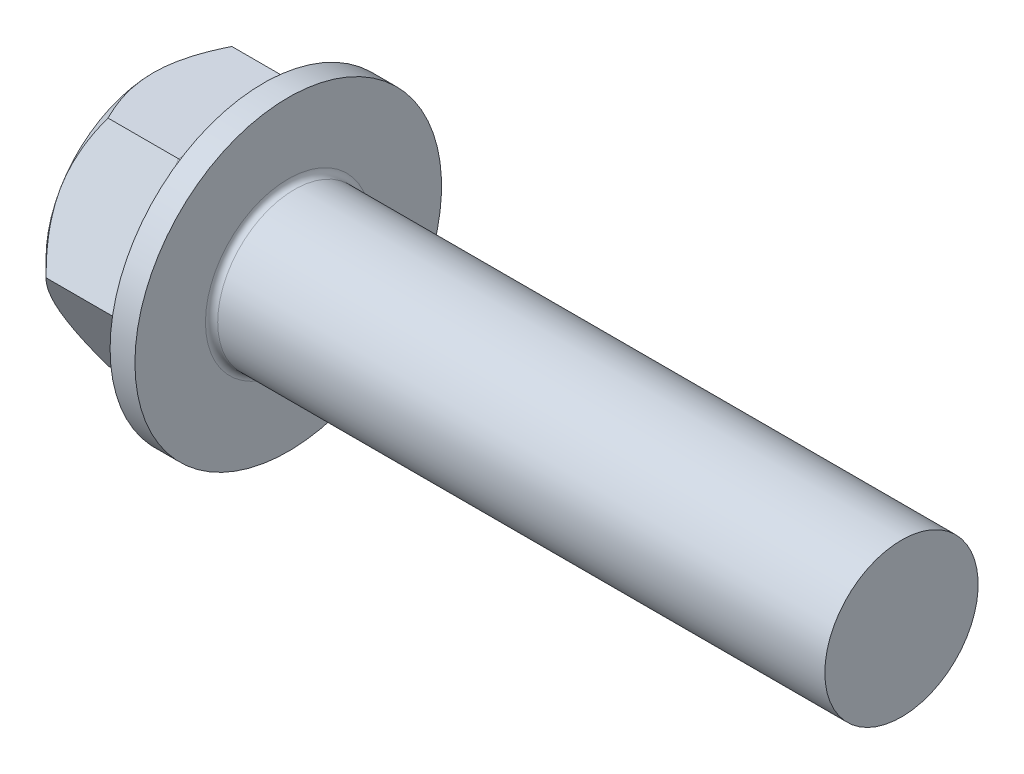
ISO-10303-21;
HEADER;
FILE_DESCRIPTION(('STEP AP214'),'2;1');
FILE_NAME('part.step','',(''),(''),'','','');
FILE_SCHEMA(('AUTOMOTIVE_DESIGN { 1 0 10303 214 1 1 1 1 }'));
ENDSEC;
DATA;
#1=APPLICATION_CONTEXT('core data for automotive mechanical design processes');
#2=APPLICATION_PROTOCOL_DEFINITION('international standard','automotive_design',2000,#1);
#3=PRODUCT_CONTEXT('',#1,'mechanical');
#4=PRODUCT('Part','Part','',(#3));
#5=PRODUCT_RELATED_PRODUCT_CATEGORY('part','',(#4));
#6=PRODUCT_DEFINITION_FORMATION('','',#4);
#7=PRODUCT_DEFINITION_CONTEXT('part definition',#1,'design');
#8=PRODUCT_DEFINITION('design','',#6,#7);
#9=PRODUCT_DEFINITION_SHAPE('','',#8);
#10=(LENGTH_UNIT() NAMED_UNIT(*) SI_UNIT(.MILLI.,.METRE.));
#11=(NAMED_UNIT(*) PLANE_ANGLE_UNIT() SI_UNIT($,.RADIAN.));
#12=(NAMED_UNIT(*) SI_UNIT($,.STERADIAN.) SOLID_ANGLE_UNIT());
#13=UNCERTAINTY_MEASURE_WITH_UNIT(LENGTH_MEASURE(1.E-05),#10,'distance_accuracy_value','');
#14=(GEOMETRIC_REPRESENTATION_CONTEXT(3) GLOBAL_UNCERTAINTY_ASSIGNED_CONTEXT((#13)) GLOBAL_UNIT_ASSIGNED_CONTEXT((#10,
#11,#12)) REPRESENTATION_CONTEXT('',''));
#15=CARTESIAN_POINT('',(0.,0.,0.));
#16=DIRECTION('',(0.,0.,1.));
#17=DIRECTION('',(1.,0.,0.));
#18=AXIS2_PLACEMENT_3D('',#15,#16,#17);
#19=CARTESIAN_POINT('',(0.,0.,0.));
#20=DIRECTION('',(1.,0.,0.));
#21=DIRECTION('',(0.,0.,-1.));
#22=AXIS2_PLACEMENT_3D('',#19,#20,#21);
#23=PLANE('',#22);
#24=CARTESIAN_POINT('',(0.,0.,0.));
#25=DIRECTION('',(1.,0.,0.));
#26=DIRECTION('',(0.,0.,-1.));
#27=AXIS2_PLACEMENT_3D('',#24,#25,#26);
#28=CIRCLE('',#27,7.);
#29=CARTESIAN_POINT('',(0.,-3.5,-6.06217782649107));
#30=VERTEX_POINT('',#29);
#31=CARTESIAN_POINT('',(0.,3.5,-6.06217782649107));
#32=VERTEX_POINT('',#31);
#33=EDGE_CURVE('E168',#30,#32,#28,.T.);
#34=ORIENTED_EDGE('',*,*,#33,.F.);
#35=CARTESIAN_POINT('',(0.,-7.,0.));
#36=VERTEX_POINT('',#35);
#37=EDGE_CURVE('E171',#36,#30,#28,.T.);
#38=ORIENTED_EDGE('',*,*,#37,.F.);
#39=CARTESIAN_POINT('',(0.,-3.5,6.06217782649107));
#40=VERTEX_POINT('',#39);
#41=EDGE_CURVE('E177',#40,#36,#28,.T.);
#42=ORIENTED_EDGE('',*,*,#41,.F.);
#43=CARTESIAN_POINT('',(0.,3.5,6.06217782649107));
#44=VERTEX_POINT('',#43);
#45=EDGE_CURVE('E169',#44,#40,#28,.T.);
#46=ORIENTED_EDGE('',*,*,#45,.F.);
#47=CARTESIAN_POINT('',(0.,7.,0.));
#48=VERTEX_POINT('',#47);
#49=EDGE_CURVE('E167',#48,#44,#28,.T.);
#50=ORIENTED_EDGE('',*,*,#49,.F.);
#51=EDGE_CURVE('E144',#32,#48,#28,.T.);
#52=ORIENTED_EDGE('',*,*,#51,.F.);
#53=EDGE_LOOP('',(#34,#38,#42,#46,#50,#52));
#54=FACE_BOUND('',#53,.T.);
#55=CARTESIAN_POINT('',(0.,0.,0.));
#56=DIRECTION('',(1.,0.,0.));
#57=DIRECTION('',(0.,0.,-1.));
#58=AXIS2_PLACEMENT_3D('',#55,#56,#57);
#59=CIRCLE('',#58,5.95);
#60=CARTESIAN_POINT('',(0.,0.,-5.95));
#61=VERTEX_POINT('',#60);
#62=EDGE_CURVE('E179',#61,#61,#59,.T.);
#63=ORIENTED_EDGE('',*,*,#62,.T.);
#64=EDGE_LOOP('',(#63));
#65=FACE_BOUND('',#64,.T.);
#66=ADVANCED_FACE('F33',(#54,#65),#23,.F.);
#67=CARTESIAN_POINT('',(7.18,10.,0.));
#68=DIRECTION('',(1.,0.,0.));
#69=DIRECTION('',(0.,0.,-1.));
#70=AXIS2_PLACEMENT_3D('',#67,#68,#69);
#71=PLANE('',#70);
#72=DIRECTION('',(0.,0.866025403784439,-0.5));
#73=VECTOR('',#72,1.);
#74=CARTESIAN_POINT('',(7.18,-0.749999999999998,-9.38194187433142));
#75=LINE('',#74,#73);
#76=CARTESIAN_POINT('',(7.18,-8.5,-4.90747728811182));
#77=VERTEX_POINT('',#76);
#78=CARTESIAN_POINT('',(7.18,0.,-9.81495457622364));
#79=VERTEX_POINT('',#78);
#80=EDGE_CURVE('E219',#77,#79,#75,.T.);
#81=ORIENTED_EDGE('',*,*,#80,.T.);
#82=DIRECTION('',(0.,0.866025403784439,0.5));
#83=VECTOR('',#82,1.);
#84=CARTESIAN_POINT('',(7.18,7.75,-5.34048999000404));
#85=LINE('',#84,#83);
#86=CARTESIAN_POINT('',(7.18,8.5,-4.90747728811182));
#87=VERTEX_POINT('',#86);
#88=EDGE_CURVE('E230',#79,#87,#85,.T.);
#89=ORIENTED_EDGE('',*,*,#88,.T.);
#90=DIRECTION('',(0.,0.,1.));
#91=VECTOR('',#90,1.);
#92=CARTESIAN_POINT('',(7.18,8.5,4.04145188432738));
#93=LINE('',#92,#91);
#94=CARTESIAN_POINT('',(7.18,8.5,4.90747728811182));
#95=VERTEX_POINT('',#94);
#96=EDGE_CURVE('E237',#87,#95,#93,.T.);
#97=ORIENTED_EDGE('',*,*,#96,.T.);
#98=DIRECTION('',(0.,-0.866025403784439,0.5));
#99=VECTOR('',#98,1.);
#100=CARTESIAN_POINT('',(7.18,0.749999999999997,9.38194187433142));
#101=LINE('',#100,#99);
#102=CARTESIAN_POINT('',(7.18,0.,9.81495457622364));
#103=VERTEX_POINT('',#102);
#104=EDGE_CURVE('E239',#95,#103,#101,.T.);
#105=ORIENTED_EDGE('',*,*,#104,.T.);
#106=DIRECTION('',(0.,-0.866025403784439,-0.5));
#107=VECTOR('',#106,1.);
#108=CARTESIAN_POINT('',(7.18,-7.75000000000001,5.34048999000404));
#109=LINE('',#108,#107);
#110=CARTESIAN_POINT('',(7.18,-8.5,4.90747728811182));
#111=VERTEX_POINT('',#110);
#112=EDGE_CURVE('E235',#103,#111,#109,.T.);
#113=ORIENTED_EDGE('',*,*,#112,.T.);
#114=DIRECTION('',(0.,0.,-1.));
#115=VECTOR('',#114,1.);
#116=CARTESIAN_POINT('',(7.18,-8.5,-4.04145188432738));
#117=LINE('',#116,#115);
#118=EDGE_CURVE('E221',#111,#77,#117,.T.);
#119=ORIENTED_EDGE('',*,*,#118,.T.);
#120=EDGE_LOOP('',(#81,#89,#97,#105,#113,#119));
#121=FACE_BOUND('',#120,.T.);
#122=CARTESIAN_POINT('',(7.18,0.,0.));
#123=DIRECTION('',(-1.,0.,0.));
#124=DIRECTION('',(0.,0.,1.));
#125=AXIS2_PLACEMENT_3D('',#122,#123,#124);
#126=CIRCLE('',#125,10.);
#127=CARTESIAN_POINT('',(7.18,0.,10.));
#128=VERTEX_POINT('',#127);
#129=EDGE_CURVE('E249',#128,#128,#126,.T.);
#130=ORIENTED_EDGE('',*,*,#129,.T.);
#131=EDGE_LOOP('',(#130));
#132=FACE_BOUND('',#131,.T.);
#133=ADVANCED_FACE('F312',(#121,#132),#71,.F.);
#134=CARTESIAN_POINT('',(0.,0.,0.));
#135=DIRECTION('',(-1.,0.,0.));
#136=DIRECTION('',(0.,0.,1.));
#137=AXIS2_PLACEMENT_3D('',#134,#135,#136);
#138=CYLINDRICAL_SURFACE('',#137,10.);
#139=ORIENTED_EDGE('',*,*,#129,.F.);
#140=EDGE_LOOP('',(#139));
#141=FACE_BOUND('',#140,.T.);
#142=CARTESIAN_POINT('',(8.8,0.,0.));
#143=DIRECTION('',(-1.,0.,0.));
#144=DIRECTION('',(0.,0.,1.));
#145=AXIS2_PLACEMENT_3D('',#142,#143,#144);
#146=CIRCLE('',#145,10.);
#147=CARTESIAN_POINT('',(8.8,0.,10.));
#148=VERTEX_POINT('',#147);
#149=EDGE_CURVE('E363',#148,#148,#146,.T.);
#150=ORIENTED_EDGE('',*,*,#149,.T.);
#151=EDGE_LOOP('',(#150));
#152=FACE_BOUND('',#151,.T.);
#153=ADVANCED_FACE('F309',(#141,#152),#138,.T.);
#154=CARTESIAN_POINT('',(8.8,10.,0.));
#155=DIRECTION('',(-1.,0.,0.));
#156=DIRECTION('',(0.,0.,1.));
#157=AXIS2_PLACEMENT_3D('',#154,#155,#156);
#158=PLANE('',#157);
#159=CARTESIAN_POINT('',(8.8,0.,0.));
#160=DIRECTION('',(-1.,0.,0.));
#161=DIRECTION('',(0.,0.,1.));
#162=AXIS2_PLACEMENT_3D('',#159,#160,#161);
#163=CIRCLE('',#162,5.4);
#164=CARTESIAN_POINT('',(8.8,0.,5.4));
#165=VERTEX_POINT('',#164);
#166=EDGE_CURVE('E41',#165,#165,#163,.T.);
#167=ORIENTED_EDGE('',*,*,#166,.T.);
#168=EDGE_LOOP('',(#167));
#169=FACE_BOUND('',#168,.T.);
#170=ORIENTED_EDGE('',*,*,#149,.F.);
#171=EDGE_LOOP('',(#170));
#172=FACE_BOUND('',#171,.T.);
#173=ADVANCED_FACE('F305',(#169,#172),#158,.F.);
#174=CARTESIAN_POINT('',(0.,0.,0.));
#175=DIRECTION('',(-1.,0.,0.));
#176=DIRECTION('',(0.,0.,1.));
#177=AXIS2_PLACEMENT_3D('',#174,#175,#176);
#178=CYLINDRICAL_SURFACE('',#177,5.);
#179=CARTESIAN_POINT('',(9.2,0.,0.));
#180=DIRECTION('',(-1.,0.,0.));
#181=DIRECTION('',(0.,0.,1.));
#182=AXIS2_PLACEMENT_3D('',#179,#180,#181);
#183=CIRCLE('',#182,5.);
#184=CARTESIAN_POINT('',(9.2,0.,5.));
#185=VERTEX_POINT('',#184);
#186=EDGE_CURVE('E11',#185,#185,#183,.F.);
#187=ORIENTED_EDGE('',*,*,#186,.T.);
#188=EDGE_LOOP('',(#187));
#189=FACE_BOUND('',#188,.T.);
#190=CARTESIAN_POINT('',(48.8,0.,0.));
#191=DIRECTION('',(-1.,0.,0.));
#192=DIRECTION('',(0.,0.,1.));
#193=AXIS2_PLACEMENT_3D('',#190,#191,#192);
#194=CIRCLE('',#193,5.);
#195=CARTESIAN_POINT('',(48.8,0.,5.));
#196=VERTEX_POINT('',#195);
#197=EDGE_CURVE('E361',#196,#196,#194,.T.);
#198=ORIENTED_EDGE('',*,*,#197,.T.);
#199=EDGE_LOOP('',(#198));
#200=FACE_BOUND('',#199,.T.);
#201=ADVANCED_FACE('F301',(#189,#200),#178,.T.);
#202=CARTESIAN_POINT('',(48.8,5.,0.));
#203=DIRECTION('',(-1.,0.,0.));
#204=DIRECTION('',(0.,0.,1.));
#205=AXIS2_PLACEMENT_3D('',#202,#203,#204);
#206=PLANE('',#205);
#207=ORIENTED_EDGE('',*,*,#197,.F.);
#208=EDGE_LOOP('',(#207));
#209=FACE_BOUND('',#208,.T.);
#210=ADVANCED_FACE('F295',(#209),#206,.F.);
#211=CARTESIAN_POINT('',(500000.,0.,8.08290376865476));
#212=DIRECTION('',(0.,0.5,-0.866025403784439));
#213=DIRECTION('',(0.,0.866025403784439,0.5));
#214=AXIS2_PLACEMENT_3D('',#211,#212,#213);
#215=PLANE('',#214);
#216=DIRECTION('',(-1.,0.,0.));
#217=VECTOR('',#216,1.);
#218=CARTESIAN_POINT('',(500000.,-7.,4.04145188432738));
#219=LINE('',#218,#217);
#220=CARTESIAN_POINT('',(5.68000000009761,-7.,4.04145188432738));
#221=VERTEX_POINT('',#220);
#222=CARTESIAN_POINT('',(1.08290376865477,-7.,4.04145188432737));
#223=VERTEX_POINT('',#222);
#224=EDGE_CURVE('E359',#221,#223,#219,.T.);
#225=ORIENTED_EDGE('',*,*,#224,.F.);
#226=DIRECTION('',(0.,-0.866025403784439,-0.5));
#227=VECTOR('',#226,1.);
#228=CARTESIAN_POINT('',(5.68,0.,8.08290376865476));
#229=LINE('',#228,#227);
#230=CARTESIAN_POINT('',(5.68000000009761,0.,8.08290376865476));
#231=VERTEX_POINT('',#230);
#232=EDGE_CURVE('E56',#221,#231,#229,.F.);
#233=ORIENTED_EDGE('',*,*,#232,.T.);
#234=DIRECTION('',(-1.,0.,0.));
#235=VECTOR('',#234,1.);
#236=CARTESIAN_POINT('',(500000.,0.,8.08290376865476));
#237=LINE('',#236,#235);
#238=CARTESIAN_POINT('',(1.08290376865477,0.,8.08290376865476));
#239=VERTEX_POINT('',#238);
#240=EDGE_CURVE('E357',#231,#239,#237,.T.);
#241=ORIENTED_EDGE('',*,*,#240,.T.);
#242=CARTESIAN_POINT('',(1.08301924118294,0.000199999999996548,8.0830192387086));
#243=CARTESIAN_POINT('',(1.01353712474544,-0.120159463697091,8.01352966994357));
#244=CARTESIAN_POINT('',(0.946187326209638,-0.241444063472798,7.94350597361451));
#245=CARTESIAN_POINT('',(0.816401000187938,-0.486045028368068,7.80228554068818));
#246=CARTESIAN_POINT('',(0.753967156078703,-0.609362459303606,7.73108818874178));
#247=CARTESIAN_POINT('',(0.574480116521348,-0.98378184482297,7.51491705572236));
#248=CARTESIAN_POINT('',(0.466007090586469,-1.23805341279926,7.36811329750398));
#249=CARTESIAN_POINT('',(0.280254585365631,-1.75081233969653,7.07207179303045));
#250=CARTESIAN_POINT('',(0.202507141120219,-2.0091686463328,6.92290970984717));
#251=CARTESIAN_POINT('',(0.11257250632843,-2.40095049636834,6.69671435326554));
#252=CARTESIAN_POINT('',(0.0870540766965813,-2.53212124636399,6.62098288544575));
#253=CARTESIAN_POINT('',(0.0454901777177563,-2.7955733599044,6.46887873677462));
#254=CARTESIAN_POINT('',(0.0294432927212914,-2.92785455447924,6.3925061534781));
#255=CARTESIAN_POINT('',(0.00253830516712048,-3.25020698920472,6.20639588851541));
#256=CARTESIAN_POINT('',(-0.00310677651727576,-3.44062555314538,6.09645767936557));
#257=CARTESIAN_POINT('',(0.00636879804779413,-3.82111946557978,5.87677941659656));
#258=CARTESIAN_POINT('',(0.021496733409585,-4.0111946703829,5.7670394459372));
#259=CARTESIAN_POINT('',(0.0716266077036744,-4.38955306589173,5.54859412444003));
#260=CARTESIAN_POINT('',(0.106650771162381,-4.57783401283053,5.43989006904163));
#261=CARTESIAN_POINT('',(0.194668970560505,-4.95115981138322,5.22435031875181));
#262=CARTESIAN_POINT('',(0.247661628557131,-5.1362049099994,5.11751448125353));
#263=CARTESIAN_POINT('',(0.35668282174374,-5.46469033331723,4.92786333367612));
#264=CARTESIAN_POINT('',(0.40984393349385,-5.60885807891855,4.84462804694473));
#265=CARTESIAN_POINT('',(0.524732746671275,-5.89460563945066,4.67965161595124));
#266=CARTESIAN_POINT('',(0.586460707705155,-6.03618537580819,4.59791051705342));
#267=CARTESIAN_POINT('',(0.71709954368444,-6.31631098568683,4.43617992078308));
#268=CARTESIAN_POINT('',(0.785987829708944,-6.45486482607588,4.35618582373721));
#269=CARTESIAN_POINT('',(0.93004292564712,-6.72940692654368,4.19767886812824));
#270=CARTESIAN_POINT('',(1.00520588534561,-6.86539669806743,4.11916513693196));
#271=CARTESIAN_POINT('',(1.08301924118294,-7.0002,4.04133641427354));
#272=B_SPLINE_CURVE_WITH_KNOTS('',3,(#242,#243,#244,#245,#246,#247,#248,#249,#250,#251,#252,
#253,#254,#255,#256,#257,#258,#259,#260,#261,#262,#263,#264,#265,#266,#267,#268,#269,#270,#271),
.UNSPECIFIED.,.F.,.F.,(4,2,2,2,2,2,2,2,2,2,2,2,2,2,4),(0.,0.466112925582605,0.932478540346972,
1.87024464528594,2.79312018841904,3.25365289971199,3.71411676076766,4.37293813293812,
5.03199042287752,5.69178034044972,6.35151967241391,6.87553223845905,7.39956068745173,
7.92198344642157,8.44408796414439),.UNSPECIFIED.);
#273=EDGE_CURVE('E152',#239,#40,#272,.T.);
#274=ORIENTED_EDGE('',*,*,#273,.T.);
#275=EDGE_CURVE('E155',#40,#223,#272,.T.);
#276=ORIENTED_EDGE('',*,*,#275,.T.);
#277=EDGE_LOOP('',(#225,#233,#241,#274,#276));
#278=FACE_BOUND('',#277,.T.);
#279=ADVANCED_FACE('F292',(#278),#215,.F.);
#280=CARTESIAN_POINT('',(500000.,-7.,4.04145188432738));
#281=DIRECTION('',(0.,1.,0.));
#282=DIRECTION('',(0.,0.,1.));
#283=AXIS2_PLACEMENT_3D('',#280,#281,#282);
#284=PLANE('',#283);
#285=DIRECTION('',(-1.,0.,0.));
#286=VECTOR('',#285,1.);
#287=CARTESIAN_POINT('',(500000.,-7.,-4.04145188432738));
#288=LINE('',#287,#286);
#289=CARTESIAN_POINT('',(5.68000000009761,-7.,-4.04145188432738));
#290=VERTEX_POINT('',#289);
#291=CARTESIAN_POINT('',(1.08290376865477,-6.99999999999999,-4.04145188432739));
#292=VERTEX_POINT('',#291);
#293=EDGE_CURVE('E136',#290,#292,#288,.T.);
#294=ORIENTED_EDGE('',*,*,#293,.F.);
#295=DIRECTION('',(0.,0.,-1.));
#296=VECTOR('',#295,1.);
#297=CARTESIAN_POINT('',(5.68,-7.,4.04145188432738));
#298=LINE('',#297,#296);
#299=EDGE_CURVE('E222',#290,#221,#298,.F.);
#300=ORIENTED_EDGE('',*,*,#299,.T.);
#301=ORIENTED_EDGE('',*,*,#224,.T.);
#302=CARTESIAN_POINT('',(3.96062693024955,-7.,-8.43417706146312));
#303=CARTESIAN_POINT('',(3.80386485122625,-7.,-8.23041129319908));
#304=CARTESIAN_POINT('',(3.6485074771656,-7.,-8.02554759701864));
#305=CARTESIAN_POINT('',(3.34124389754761,-7.,-7.61317558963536));
#306=CARTESIAN_POINT('',(3.18933851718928,-7.,-7.40566666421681));
#307=CARTESIAN_POINT('',(2.88853965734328,-7.,-6.98603902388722));
#308=CARTESIAN_POINT('',(2.739678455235,-7.,-6.7738970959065));
#309=CARTESIAN_POINT('',(2.44713646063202,-7.,-6.34608257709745));
#310=CARTESIAN_POINT('',(2.30345531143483,-7.,-6.1304102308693));
#311=CARTESIAN_POINT('',(2.01354429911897,-7.,-5.68113447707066));
#312=CARTESIAN_POINT('',(1.86773051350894,-7.,-5.44726122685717));
#313=CARTESIAN_POINT('',(1.58515337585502,-7.,-4.97402257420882));
#314=CARTESIAN_POINT('',(1.44839154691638,-7.,-4.73465625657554));
#315=CARTESIAN_POINT('',(1.18683085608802,-7.,-4.25036598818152));
#316=CARTESIAN_POINT('',(1.06199687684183,-7.,-4.00546115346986));
#317=CARTESIAN_POINT('',(0.827088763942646,-7.,-3.50872825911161));
#318=CARTESIAN_POINT('',(0.717007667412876,-7.,-3.25690353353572));
#319=CARTESIAN_POINT('',(0.525534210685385,-7.,-2.77100064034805));
#320=CARTESIAN_POINT('',(0.44238295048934,-7.,-2.53762269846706));
#321=CARTESIAN_POINT('',(0.294760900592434,-7.,-2.06492104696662));
#322=CARTESIAN_POINT('',(0.230291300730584,-7.,-1.82559695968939));
#323=CARTESIAN_POINT('',(0.124596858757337,-7.,-1.34660053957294));
#324=CARTESIAN_POINT('',(0.0829498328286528,-7.,-1.10702295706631));
#325=CARTESIAN_POINT('',(0.0237693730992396,-7.,-0.624891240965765));
#326=CARTESIAN_POINT('',(0.00623093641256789,-7.,-0.382337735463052));
#327=CARTESIAN_POINT('',(-0.00323838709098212,-7.,0.0926637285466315));
#328=CARTESIAN_POINT('',(0.00374551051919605,-7.,0.325090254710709));
#329=CARTESIAN_POINT('',(0.0404439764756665,-7.,0.788129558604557));
#330=CARTESIAN_POINT('',(0.0701606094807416,-7.,1.0187421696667));
#331=CARTESIAN_POINT('',(0.15114938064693,-7.,1.48039296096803));
#332=CARTESIAN_POINT('',(0.202802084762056,-7.,1.71136323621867));
#333=CARTESIAN_POINT('',(0.324797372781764,-7.,2.16821741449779));
#334=CARTESIAN_POINT('',(0.395138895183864,-7.,2.39410160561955));
#335=CARTESIAN_POINT('',(0.55592514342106,-7.,2.85322776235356));
#336=CARTESIAN_POINT('',(0.647295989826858,-7.,3.08614168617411));
#337=CARTESIAN_POINT('',(0.844153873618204,-7.,3.54597855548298));
#338=CARTESIAN_POINT('',(0.949647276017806,-7.,3.77289874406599));
#339=CARTESIAN_POINT('',(1.17224851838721,-7.,4.22181978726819));
#340=CARTESIAN_POINT('',(1.28939213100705,-7.,4.44380275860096));
#341=CARTESIAN_POINT('',(1.5327159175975,-7.,4.88268206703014));
#342=CARTESIAN_POINT('',(1.65889470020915,-7.,5.09957918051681));
#343=CARTESIAN_POINT('',(1.91211455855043,-7.,5.51835088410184));
#344=CARTESIAN_POINT('',(2.03880536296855,-7.,5.72043839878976));
#345=CARTESIAN_POINT('',(2.29757957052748,-7.,6.12114141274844));
#346=CARTESIAN_POINT('',(2.42966337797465,-7.,6.31975665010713));
#347=CARTESIAN_POINT('',(2.69718660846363,-7.,6.71237253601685));
#348=CARTESIAN_POINT('',(2.83259057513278,-7.,6.90639743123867));
#349=CARTESIAN_POINT('',(3.10702821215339,-7.,7.29178546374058));
#350=CARTESIAN_POINT('',(3.24606087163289,-7.,7.48314932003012));
#351=CARTESIAN_POINT('',(3.38657884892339,-7.,7.67339691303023));
#352=B_SPLINE_CURVE_WITH_KNOTS('',3,(#302,#303,#304,#305,#306,#307,#308,#309,#310,#311,#312,
#313,#314,#315,#316,#317,#318,#319,#320,#321,#322,#323,#324,#325,#326,#327,#328,#329,#330,#331,
#332,#333,#334,#335,#336,#337,#338,#339,#340,#341,#342,#343,#344,#345,#346,#347,#348,#349,#350,
#351),.UNSPECIFIED.,.F.,.F.,(4,2,2,2,2,2,2,2,2,2,2,2,2,2,2,2,2,2,2,2,2,2,2,2,4),(0.,
0.771281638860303,1.54274575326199,2.32016156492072,3.09752374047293,3.92417717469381,
4.75096935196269,5.57524705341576,6.3991343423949,7.14173972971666,7.88439240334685,
8.61279864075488,9.34105370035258,10.0374943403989,10.7339982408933,11.4431138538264,
12.1521891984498,12.9021990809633,13.6525481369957,14.4052768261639,15.1578898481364,
15.8733377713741,16.5888394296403,17.2985964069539,18.0081577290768),.UNSPECIFIED.);
#353=EDGE_CURVE('E166',#223,#36,#352,.F.);
#354=ORIENTED_EDGE('',*,*,#353,.T.);
#355=EDGE_CURVE('E164',#36,#292,#352,.F.);
#356=ORIENTED_EDGE('',*,*,#355,.T.);
#357=EDGE_LOOP('',(#294,#300,#301,#354,#356));
#358=FACE_BOUND('',#357,.T.);
#359=ADVANCED_FACE('F291',(#358),#284,.F.);
#360=CARTESIAN_POINT('',(500000.,7.,4.04145188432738));
#361=DIRECTION('',(0.,-0.5,-0.866025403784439));
#362=DIRECTION('',(0.,0.866025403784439,-0.5));
#363=AXIS2_PLACEMENT_3D('',#360,#361,#362);
#364=PLANE('',#363);
#365=ORIENTED_EDGE('',*,*,#240,.F.);
#366=DIRECTION('',(0.,-0.866025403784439,0.5));
#367=VECTOR('',#366,1.);
#368=CARTESIAN_POINT('',(5.68,7.,4.04145188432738));
#369=LINE('',#368,#367);
#370=CARTESIAN_POINT('',(5.68000000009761,7.,4.04145188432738));
#371=VERTEX_POINT('',#370);
#372=EDGE_CURVE('E48',#231,#371,#369,.F.);
#373=ORIENTED_EDGE('',*,*,#372,.T.);
#374=DIRECTION('',(-1.,0.,0.));
#375=VECTOR('',#374,1.);
#376=CARTESIAN_POINT('',(500000.,7.,4.04145188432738));
#377=LINE('',#376,#375);
#378=CARTESIAN_POINT('',(1.08290376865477,7.,4.04145188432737));
#379=VERTEX_POINT('',#378);
#380=EDGE_CURVE('E135',#371,#379,#377,.T.);
#381=ORIENTED_EDGE('',*,*,#380,.T.);
#382=CARTESIAN_POINT('',(1.08301924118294,7.0002,4.04133641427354));
#383=CARTESIAN_POINT('',(1.01353712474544,6.87984053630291,4.11082598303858));
#384=CARTESIAN_POINT('',(0.946187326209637,6.75855593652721,4.18084967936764));
#385=CARTESIAN_POINT('',(0.816401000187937,6.51395497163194,4.32207011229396));
#386=CARTESIAN_POINT('',(0.753967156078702,6.3906375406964,4.39326746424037));
#387=CARTESIAN_POINT('',(0.574480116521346,6.01621815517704,4.60943859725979));
#388=CARTESIAN_POINT('',(0.466007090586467,5.76194658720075,4.75624235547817));
#389=CARTESIAN_POINT('',(0.28025458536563,5.24918766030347,5.05228385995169));
#390=CARTESIAN_POINT('',(0.202507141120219,4.99083135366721,5.20144594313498));
#391=CARTESIAN_POINT('',(0.112572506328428,4.59904950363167,5.4276412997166));
#392=CARTESIAN_POINT('',(0.0870540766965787,4.46787875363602,5.5033727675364));
#393=CARTESIAN_POINT('',(0.0454901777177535,4.20442664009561,5.65547691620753));
#394=CARTESIAN_POINT('',(0.0294432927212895,4.07214544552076,5.73184949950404));
#395=CARTESIAN_POINT('',(0.00253830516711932,3.74979301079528,5.91795976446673));
#396=CARTESIAN_POINT('',(-0.00310677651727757,3.55937444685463,6.02789797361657));
#397=CARTESIAN_POINT('',(0.00636879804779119,3.17888053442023,6.24757623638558));
#398=CARTESIAN_POINT('',(0.0214967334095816,2.9888053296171,6.35731620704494));
#399=CARTESIAN_POINT('',(0.0716266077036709,2.61044693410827,6.57576152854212));
#400=CARTESIAN_POINT('',(0.106650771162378,2.42216598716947,6.68446558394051));
#401=CARTESIAN_POINT('',(0.194668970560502,2.04884018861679,6.90000533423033));
#402=CARTESIAN_POINT('',(0.247661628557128,1.86379509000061,7.00684117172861));
#403=CARTESIAN_POINT('',(0.356682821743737,1.53530966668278,7.19649231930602));
#404=CARTESIAN_POINT('',(0.409843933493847,1.39114192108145,7.27972760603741));
#405=CARTESIAN_POINT('',(0.524732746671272,1.10539436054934,7.44470403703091));
#406=CARTESIAN_POINT('',(0.586460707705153,0.96381462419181,7.52644513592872));
#407=CARTESIAN_POINT('',(0.717099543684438,0.683689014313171,7.68817573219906));
#408=CARTESIAN_POINT('',(0.785987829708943,0.54513517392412,7.76816982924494));
#409=CARTESIAN_POINT('',(0.93004292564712,0.270593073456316,7.92667678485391));
#410=CARTESIAN_POINT('',(1.00520588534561,0.134603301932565,8.00519051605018));
#411=CARTESIAN_POINT('',(1.08301924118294,-0.000200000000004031,8.0830192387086));
#412=B_SPLINE_CURVE_WITH_KNOTS('',3,(#382,#383,#384,#385,#386,#387,#388,#389,#390,#391,#392,
#393,#394,#395,#396,#397,#398,#399,#400,#401,#402,#403,#404,#405,#406,#407,#408,#409,#410,#411),
.UNSPECIFIED.,.F.,.F.,(4,2,2,2,2,2,2,2,2,2,2,2,2,2,4),(0.,0.466112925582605,0.932478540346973,
1.87024464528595,2.79312018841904,3.253652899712,3.71411676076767,4.37293813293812,
5.03199042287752,5.69178034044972,6.35151967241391,6.87553223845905,7.39956068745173,
7.92198344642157,8.44408796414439),.UNSPECIFIED.);
#413=EDGE_CURVE('E354',#379,#44,#412,.T.);
#414=ORIENTED_EDGE('',*,*,#413,.T.);
#415=EDGE_CURVE('E146',#44,#239,#412,.T.);
#416=ORIENTED_EDGE('',*,*,#415,.T.);
#417=EDGE_LOOP('',(#365,#373,#381,#414,#416));
#418=FACE_BOUND('',#417,.T.);
#419=ADVANCED_FACE('F287',(#418),#364,.F.);
#420=CARTESIAN_POINT('',(500000.,7.,-4.04145188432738));
#421=DIRECTION('',(0.,-1.,0.));
#422=DIRECTION('',(0.,0.,-1.));
#423=AXIS2_PLACEMENT_3D('',#420,#421,#422);
#424=PLANE('',#423);
#425=ORIENTED_EDGE('',*,*,#380,.F.);
#426=DIRECTION('',(0.,0.,1.));
#427=VECTOR('',#426,1.);
#428=CARTESIAN_POINT('',(5.68,7.,-4.04145188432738));
#429=LINE('',#428,#427);
#430=CARTESIAN_POINT('',(5.68000000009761,7.,-4.04145188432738));
#431=VERTEX_POINT('',#430);
#432=EDGE_CURVE('E130',#371,#431,#429,.F.);
#433=ORIENTED_EDGE('',*,*,#432,.T.);
#434=DIRECTION('',(-1.,0.,0.));
#435=VECTOR('',#434,1.);
#436=CARTESIAN_POINT('',(500000.,7.,-4.04145188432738));
#437=LINE('',#436,#435);
#438=CARTESIAN_POINT('',(1.08290376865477,7.,-4.04145188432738));
#439=VERTEX_POINT('',#438);
#440=EDGE_CURVE('E123',#431,#439,#437,.T.);
#441=ORIENTED_EDGE('',*,*,#440,.T.);
#442=CARTESIAN_POINT('',(3.96062693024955,7.,-8.43417706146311));
#443=CARTESIAN_POINT('',(3.80386485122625,7.,-8.23041129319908));
#444=CARTESIAN_POINT('',(3.6485074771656,7.,-8.02554759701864));
#445=CARTESIAN_POINT('',(3.34124389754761,7.,-7.61317558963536));
#446=CARTESIAN_POINT('',(3.18933851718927,7.,-7.40566666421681));
#447=CARTESIAN_POINT('',(2.88853965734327,7.,-6.98603902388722));
#448=CARTESIAN_POINT('',(2.739678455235,7.,-6.7738970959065));
#449=CARTESIAN_POINT('',(2.44713646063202,7.,-6.34608257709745));
#450=CARTESIAN_POINT('',(2.30345531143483,7.,-6.1304102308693));
#451=CARTESIAN_POINT('',(2.01354429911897,7.,-5.68113447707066));
#452=CARTESIAN_POINT('',(1.86773051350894,7.,-5.44726122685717));
#453=CARTESIAN_POINT('',(1.58515337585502,7.,-4.97402257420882));
#454=CARTESIAN_POINT('',(1.44839154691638,7.,-4.73465625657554));
#455=CARTESIAN_POINT('',(1.18683085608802,7.,-4.25036598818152));
#456=CARTESIAN_POINT('',(1.06199687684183,7.,-4.00546115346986));
#457=CARTESIAN_POINT('',(0.827088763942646,7.,-3.50872825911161));
#458=CARTESIAN_POINT('',(0.717007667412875,7.,-3.25690353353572));
#459=CARTESIAN_POINT('',(0.525534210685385,7.,-2.77100064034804));
#460=CARTESIAN_POINT('',(0.44238295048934,7.,-2.53762269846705));
#461=CARTESIAN_POINT('',(0.294760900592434,7.,-2.06492104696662));
#462=CARTESIAN_POINT('',(0.230291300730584,7.,-1.82559695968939));
#463=CARTESIAN_POINT('',(0.124596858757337,7.,-1.34660053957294));
#464=CARTESIAN_POINT('',(0.0829498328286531,7.,-1.10702295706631));
#465=CARTESIAN_POINT('',(0.0237693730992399,7.,-0.624891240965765));
#466=CARTESIAN_POINT('',(0.00623093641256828,7.,-0.382337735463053));
#467=CARTESIAN_POINT('',(-0.00323838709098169,7.,0.0926637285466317));
#468=CARTESIAN_POINT('',(0.00374551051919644,7.,0.325090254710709));
#469=CARTESIAN_POINT('',(0.040443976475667,7.,0.788129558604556));
#470=CARTESIAN_POINT('',(0.0701606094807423,7.,1.0187421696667));
#471=CARTESIAN_POINT('',(0.15114938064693,7.,1.48039296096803));
#472=CARTESIAN_POINT('',(0.202802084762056,7.,1.71136323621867));
#473=CARTESIAN_POINT('',(0.324797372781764,7.,2.16821741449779));
#474=CARTESIAN_POINT('',(0.395138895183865,7.,2.39410160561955));
#475=CARTESIAN_POINT('',(0.555925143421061,7.,2.85322776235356));
#476=CARTESIAN_POINT('',(0.647295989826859,7.,3.08614168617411));
#477=CARTESIAN_POINT('',(0.844153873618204,7.,3.54597855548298));
#478=CARTESIAN_POINT('',(0.949647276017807,7.,3.77289874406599));
#479=CARTESIAN_POINT('',(1.17224851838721,7.,4.22181978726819));
#480=CARTESIAN_POINT('',(1.28939213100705,7.,4.44380275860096));
#481=CARTESIAN_POINT('',(1.5327159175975,7.,4.88268206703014));
#482=CARTESIAN_POINT('',(1.65889470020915,7.,5.09957918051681));
#483=CARTESIAN_POINT('',(1.91211455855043,7.,5.51835088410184));
#484=CARTESIAN_POINT('',(2.03880536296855,7.,5.72043839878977));
#485=CARTESIAN_POINT('',(2.29757957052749,7.,6.12114141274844));
#486=CARTESIAN_POINT('',(2.42966337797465,7.,6.31975665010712));
#487=CARTESIAN_POINT('',(2.69718660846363,7.,6.71237253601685));
#488=CARTESIAN_POINT('',(2.83259057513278,7.,6.90639743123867));
#489=CARTESIAN_POINT('',(3.10702821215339,7.,7.29178546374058));
#490=CARTESIAN_POINT('',(3.24606087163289,7.,7.48314932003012));
#491=CARTESIAN_POINT('',(3.38657884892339,7.,7.67339691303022));
#492=B_SPLINE_CURVE_WITH_KNOTS('',3,(#442,#443,#444,#445,#446,#447,#448,#449,#450,#451,#452,
#453,#454,#455,#456,#457,#458,#459,#460,#461,#462,#463,#464,#465,#466,#467,#468,#469,#470,#471,
#472,#473,#474,#475,#476,#477,#478,#479,#480,#481,#482,#483,#484,#485,#486,#487,#488,#489,#490,
#491),.UNSPECIFIED.,.F.,.F.,(4,2,2,2,2,2,2,2,2,2,2,2,2,2,2,2,2,2,2,2,2,2,2,2,4),(0.,
0.771281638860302,1.54274575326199,2.32016156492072,3.09752374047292,3.9241771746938,
4.75096935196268,5.57524705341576,6.39913434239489,7.14173972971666,7.88439240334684,
8.61279864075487,9.34105370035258,10.0374943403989,10.7339982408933,11.4431138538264,
12.1521891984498,12.9021990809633,13.6525481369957,14.4052768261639,15.1578898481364,
15.8733377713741,16.5888394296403,17.2985964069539,18.0081577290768),.UNSPECIFIED.);
#493=EDGE_CURVE('E127',#439,#48,#492,.T.);
#494=ORIENTED_EDGE('',*,*,#493,.T.);
#495=EDGE_CURVE('E148',#48,#379,#492,.T.);
#496=ORIENTED_EDGE('',*,*,#495,.T.);
#497=EDGE_LOOP('',(#425,#433,#441,#494,#496));
#498=FACE_BOUND('',#497,.T.);
#499=ADVANCED_FACE('F125',(#498),#424,.F.);
#500=CARTESIAN_POINT('',(500000.,0.,-8.08290376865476));
#501=DIRECTION('',(0.,-0.5,0.866025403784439));
#502=DIRECTION('',(0.,-0.866025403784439,-0.5));
#503=AXIS2_PLACEMENT_3D('',#500,#501,#502);
#504=PLANE('',#503);
#505=ORIENTED_EDGE('',*,*,#440,.F.);
#506=DIRECTION('',(0.,0.866025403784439,0.5));
#507=VECTOR('',#506,1.);
#508=CARTESIAN_POINT('',(5.68,0.,-8.08290376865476));
#509=LINE('',#508,#507);
#510=CARTESIAN_POINT('',(5.68000000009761,0.,-8.08290376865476));
#511=VERTEX_POINT('',#510);
#512=EDGE_CURVE('E226',#431,#511,#509,.F.);
#513=ORIENTED_EDGE('',*,*,#512,.T.);
#514=DIRECTION('',(-1.,0.,0.));
#515=VECTOR('',#514,1.);
#516=CARTESIAN_POINT('',(500000.,0.,-8.08290376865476));
#517=LINE('',#516,#515);
#518=CARTESIAN_POINT('',(1.08290376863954,0.,-8.08290376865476));
#519=VERTEX_POINT('',#518);
#520=EDGE_CURVE('E351',#511,#519,#517,.T.);
#521=ORIENTED_EDGE('',*,*,#520,.T.);
#522=CARTESIAN_POINT('',(1.08301924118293,-0.000199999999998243,-8.0830192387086));
#523=CARTESIAN_POINT('',(1.01353712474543,0.12015946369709,-8.01352966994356));
#524=CARTESIAN_POINT('',(0.946187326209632,0.241444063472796,-7.9435059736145));
#525=CARTESIAN_POINT('',(0.816401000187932,0.486045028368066,-7.80228554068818));
#526=CARTESIAN_POINT('',(0.753967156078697,0.609362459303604,-7.73108818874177));
#527=CARTESIAN_POINT('',(0.574480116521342,0.983781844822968,-7.51491705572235));
#528=CARTESIAN_POINT('',(0.466007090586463,1.23805341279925,-7.36811329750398));
#529=CARTESIAN_POINT('',(0.280254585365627,1.75081233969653,-7.07207179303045));
#530=CARTESIAN_POINT('',(0.202507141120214,2.0091686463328,-6.92290970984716));
#531=CARTESIAN_POINT('',(0.112572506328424,2.40095049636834,-6.69671435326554));
#532=CARTESIAN_POINT('',(0.0870540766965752,2.53212124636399,-6.62098288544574));
#533=CARTESIAN_POINT('',(0.0454901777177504,2.7955733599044,-6.46887873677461));
#534=CARTESIAN_POINT('',(0.0294432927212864,2.92785455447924,-6.3925061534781));
#535=CARTESIAN_POINT('',(0.00253830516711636,3.25020698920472,-6.20639588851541));
#536=CARTESIAN_POINT('',(-0.0031067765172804,3.44062555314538,-6.09645767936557));
#537=CARTESIAN_POINT('',(0.00636879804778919,3.82111946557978,-5.87677941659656));
#538=CARTESIAN_POINT('',(0.0214967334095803,4.0111946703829,-5.7670394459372));
#539=CARTESIAN_POINT('',(0.0716266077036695,4.38955306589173,-5.54859412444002));
#540=CARTESIAN_POINT('',(0.106650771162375,4.57783401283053,-5.43989006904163));
#541=CARTESIAN_POINT('',(0.194668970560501,4.95115981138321,-5.22435031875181));
#542=CARTESIAN_POINT('',(0.247661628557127,5.13620490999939,-5.11751448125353));
#543=CARTESIAN_POINT('',(0.356682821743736,5.46469033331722,-4.92786333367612));
#544=CARTESIAN_POINT('',(0.409843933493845,5.60885807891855,-4.84462804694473));
#545=CARTESIAN_POINT('',(0.524732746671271,5.89460563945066,-4.67965161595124));
#546=CARTESIAN_POINT('',(0.586460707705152,6.03618537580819,-4.59791051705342));
#547=CARTESIAN_POINT('',(0.717099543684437,6.31631098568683,-4.43617992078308));
#548=CARTESIAN_POINT('',(0.785987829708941,6.45486482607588,-4.3561858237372));
#549=CARTESIAN_POINT('',(0.930042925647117,6.72940692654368,-4.19767886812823));
#550=CARTESIAN_POINT('',(1.00520588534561,6.86539669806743,-4.11916513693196));
#551=CARTESIAN_POINT('',(1.08301924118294,7.0002,-4.04133641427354));
#552=B_SPLINE_CURVE_WITH_KNOTS('',3,(#522,#523,#524,#525,#526,#527,#528,#529,#530,#531,#532,
#533,#534,#535,#536,#537,#538,#539,#540,#541,#542,#543,#544,#545,#546,#547,#548,#549,#550,#551),
.UNSPECIFIED.,.F.,.F.,(4,2,2,2,2,2,2,2,2,2,2,2,2,2,4),(0.,0.466112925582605,0.932478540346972,
1.87024464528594,2.79312018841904,3.25365289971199,3.71411676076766,4.37293813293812,
5.03199042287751,5.69178034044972,6.3515196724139,6.87553223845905,7.39956068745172,
7.92198344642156,8.44408796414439),.UNSPECIFIED.);
#553=EDGE_CURVE('E151',#519,#32,#552,.T.);
#554=ORIENTED_EDGE('',*,*,#553,.T.);
#555=EDGE_CURVE('E141',#32,#439,#552,.T.);
#556=ORIENTED_EDGE('',*,*,#555,.T.);
#557=EDGE_LOOP('',(#505,#513,#521,#554,#556));
#558=FACE_BOUND('',#557,.T.);
#559=ADVANCED_FACE('F149',(#558),#504,.F.);
#560=CARTESIAN_POINT('',(500000.,-7.,-4.04145188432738));
#561=DIRECTION('',(0.,0.5,0.866025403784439));
#562=DIRECTION('',(0.,-0.866025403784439,0.5));
#563=AXIS2_PLACEMENT_3D('',#560,#561,#562);
#564=PLANE('',#563);
#565=ORIENTED_EDGE('',*,*,#520,.F.);
#566=DIRECTION('',(0.,0.866025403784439,-0.5));
#567=VECTOR('',#566,1.);
#568=CARTESIAN_POINT('',(5.68,-7.,-4.04145188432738));
#569=LINE('',#568,#567);
#570=EDGE_CURVE('E218',#511,#290,#569,.F.);
#571=ORIENTED_EDGE('',*,*,#570,.T.);
#572=ORIENTED_EDGE('',*,*,#293,.T.);
#573=CARTESIAN_POINT('',(1.08301924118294,-7.0002,-4.04133641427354));
#574=CARTESIAN_POINT('',(1.01353712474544,-6.87984053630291,-4.11082598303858));
#575=CARTESIAN_POINT('',(0.946187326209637,-6.75855593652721,-4.18084967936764));
#576=CARTESIAN_POINT('',(0.816401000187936,-6.51395497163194,-4.32207011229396));
#577=CARTESIAN_POINT('',(0.7539671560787,-6.3906375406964,-4.39326746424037));
#578=CARTESIAN_POINT('',(0.574480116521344,-6.01621815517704,-4.60943859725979));
#579=CARTESIAN_POINT('',(0.466007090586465,-5.76194658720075,-4.75624235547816));
#580=CARTESIAN_POINT('',(0.280254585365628,-5.24918766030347,-5.05228385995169));
#581=CARTESIAN_POINT('',(0.202507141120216,-4.99083135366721,-5.20144594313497));
#582=CARTESIAN_POINT('',(0.112572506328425,-4.59904950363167,-5.4276412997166));
#583=CARTESIAN_POINT('',(0.0870540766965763,-4.46787875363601,-5.5033727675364));
#584=CARTESIAN_POINT('',(0.0454901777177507,-4.2044266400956,-5.65547691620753));
#585=CARTESIAN_POINT('',(0.029443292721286,-4.07214544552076,-5.73184949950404));
#586=CARTESIAN_POINT('',(0.00253830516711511,-3.74979301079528,-5.91795976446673));
#587=CARTESIAN_POINT('',(-0.00310677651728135,-3.55937444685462,-6.02789797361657));
#588=CARTESIAN_POINT('',(0.00636879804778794,-3.17888053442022,-6.24757623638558));
#589=CARTESIAN_POINT('',(0.0214967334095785,-2.9888053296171,-6.35731620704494));
#590=CARTESIAN_POINT('',(0.0716266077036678,-2.61044693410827,-6.57576152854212));
#591=CARTESIAN_POINT('',(0.106650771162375,-2.42216598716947,-6.68446558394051));
#592=CARTESIAN_POINT('',(0.194668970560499,-2.04884018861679,-6.90000533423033));
#593=CARTESIAN_POINT('',(0.247661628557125,-1.8637950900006,-7.00684117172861));
#594=CARTESIAN_POINT('',(0.356682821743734,-1.53530966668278,-7.19649231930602));
#595=CARTESIAN_POINT('',(0.409843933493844,-1.39114192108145,-7.27972760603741));
#596=CARTESIAN_POINT('',(0.524732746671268,-1.10539436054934,-7.4447040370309));
#597=CARTESIAN_POINT('',(0.586460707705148,-0.963814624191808,-7.52644513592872));
#598=CARTESIAN_POINT('',(0.717099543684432,-0.68368901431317,-7.68817573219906));
#599=CARTESIAN_POINT('',(0.785987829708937,-0.54513517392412,-7.76816982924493));
#600=CARTESIAN_POINT('',(0.930042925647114,-0.270593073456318,-7.9266767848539));
#601=CARTESIAN_POINT('',(1.00520588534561,-0.134603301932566,-8.00519051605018));
#602=CARTESIAN_POINT('',(1.08301924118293,0.000200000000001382,-8.08301923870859));
#603=B_SPLINE_CURVE_WITH_KNOTS('',3,(#573,#574,#575,#576,#577,#578,#579,#580,#581,#582,#583,
#584,#585,#586,#587,#588,#589,#590,#591,#592,#593,#594,#595,#596,#597,#598,#599,#600,#601,#602),
.UNSPECIFIED.,.F.,.F.,(4,2,2,2,2,2,2,2,2,2,2,2,2,2,4),(0.,0.466112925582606,0.932478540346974,
1.87024464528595,2.79312018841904,3.253652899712,3.71411676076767,4.37293813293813,
5.03199042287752,5.69178034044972,6.35151967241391,6.87553223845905,7.39956068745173,
7.92198344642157,8.44408796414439),.UNSPECIFIED.);
#604=EDGE_CURVE('E241',#292,#30,#603,.T.);
#605=ORIENTED_EDGE('',*,*,#604,.T.);
#606=EDGE_CURVE('E242',#30,#519,#603,.T.);
#607=ORIENTED_EDGE('',*,*,#606,.T.);
#608=EDGE_LOOP('',(#565,#571,#572,#605,#607));
#609=FACE_BOUND('',#608,.T.);
#610=ADVANCED_FACE('F251',(#609),#564,.F.);
#611=CARTESIAN_POINT('',(0.,0.,0.));
#612=DIRECTION('',(1.,0.,0.));
#613=DIRECTION('',(0.,0.,-1.));
#614=AXIS2_PLACEMENT_3D('',#611,#612,#613);
#615=CONICAL_SURFACE('',#614,7.,0.785398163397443);
#616=ORIENTED_EDGE('',*,*,#606,.F.);
#617=ORIENTED_EDGE('',*,*,#33,.T.);
#618=ORIENTED_EDGE('',*,*,#553,.F.);
#619=EDGE_LOOP('',(#616,#617,#618));
#620=FACE_BOUND('',#619,.T.);
#621=ADVANCED_FACE('F259',(#620),#615,.T.);
#622=ORIENTED_EDGE('',*,*,#37,.T.);
#623=ORIENTED_EDGE('',*,*,#604,.F.);
#624=ORIENTED_EDGE('',*,*,#355,.F.);
#625=EDGE_LOOP('',(#622,#623,#624));
#626=FACE_BOUND('',#625,.T.);
#627=ADVANCED_FACE('F393',(#626),#615,.T.);
#628=ORIENTED_EDGE('',*,*,#555,.F.);
#629=ORIENTED_EDGE('',*,*,#51,.T.);
#630=ORIENTED_EDGE('',*,*,#493,.F.);
#631=EDGE_LOOP('',(#628,#629,#630));
#632=FACE_BOUND('',#631,.T.);
#633=ADVANCED_FACE('F140',(#632),#615,.T.);
#634=ORIENTED_EDGE('',*,*,#49,.T.);
#635=ORIENTED_EDGE('',*,*,#413,.F.);
#636=ORIENTED_EDGE('',*,*,#495,.F.);
#637=EDGE_LOOP('',(#634,#635,#636));
#638=FACE_BOUND('',#637,.T.);
#639=ADVANCED_FACE('F253',(#638),#615,.T.);
#640=ORIENTED_EDGE('',*,*,#45,.T.);
#641=ORIENTED_EDGE('',*,*,#273,.F.);
#642=ORIENTED_EDGE('',*,*,#415,.F.);
#643=EDGE_LOOP('',(#640,#641,#642));
#644=FACE_BOUND('',#643,.T.);
#645=ADVANCED_FACE('F257',(#644),#615,.T.);
#646=ORIENTED_EDGE('',*,*,#41,.T.);
#647=ORIENTED_EDGE('',*,*,#353,.F.);
#648=ORIENTED_EDGE('',*,*,#275,.F.);
#649=EDGE_LOOP('',(#646,#647,#648));
#650=FACE_BOUND('',#649,.T.);
#651=ADVANCED_FACE('F379',(#650),#615,.T.);
#652=CARTESIAN_POINT('',(1.436,0.,0.));
#653=DIRECTION('',(-1.,0.,0.));
#654=DIRECTION('',(0.,0.,1.));
#655=AXIS2_PLACEMENT_3D('',#652,#653,#654);
#656=CYLINDRICAL_SURFACE('',#655,5.95);
#657=CARTESIAN_POINT('',(1.436,0.,0.));
#658=DIRECTION('',(1.,0.,0.));
#659=DIRECTION('',(0.,0.,-1.));
#660=AXIS2_PLACEMENT_3D('',#657,#658,#659);
#661=CIRCLE('',#660,5.95);
#662=CARTESIAN_POINT('',(1.436,0.,-5.95));
#663=VERTEX_POINT('',#662);
#664=EDGE_CURVE('E172',#663,#663,#661,.T.);
#665=ORIENTED_EDGE('',*,*,#664,.T.);
#666=EDGE_LOOP('',(#665));
#667=FACE_BOUND('',#666,.T.);
#668=ORIENTED_EDGE('',*,*,#62,.F.);
#669=EDGE_LOOP('',(#668));
#670=FACE_BOUND('',#669,.T.);
#671=ADVANCED_FACE('F260',(#667,#670),#656,.F.);
#672=CARTESIAN_POINT('',(1.436,0.,0.));
#673=DIRECTION('',(1.,0.,0.));
#674=DIRECTION('',(0.,0.,-1.));
#675=AXIS2_PLACEMENT_3D('',#672,#673,#674);
#676=PLANE('',#675);
#677=ORIENTED_EDGE('',*,*,#664,.F.);
#678=EDGE_LOOP('',(#677));
#679=FACE_BOUND('',#678,.T.);
#680=ADVANCED_FACE('F337',(#679),#676,.F.);
#681=CARTESIAN_POINT('',(5.68,3.24999999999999,11.6913429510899));
#682=DIRECTION('',(0.,0.866025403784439,0.5));
#683=DIRECTION('',(0.,-0.5,0.866025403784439));
#684=AXIS2_PLACEMENT_3D('',#681,#682,#683);
#685=CYLINDRICAL_SURFACE('',#684,1.5);
#686=CARTESIAN_POINT('',(5.68,0.,9.81495457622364));
#687=DIRECTION('',(0.,1.,0.));
#688=DIRECTION('',(0.,0.,-1.));
#689=AXIS2_PLACEMENT_3D('',#686,#687,#688);
#690=ELLIPSE('',#689,1.73205080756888,1.5);
#691=EDGE_CURVE('E188',#231,#103,#690,.F.);
#692=ORIENTED_EDGE('',*,*,#691,.F.);
#693=ORIENTED_EDGE('',*,*,#232,.F.);
#694=CARTESIAN_POINT('',(5.68,-8.5,4.90747728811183));
#695=DIRECTION('',(0.,0.5,0.866025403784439));
#696=DIRECTION('',(0.,0.866025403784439,-0.5));
#697=AXIS2_PLACEMENT_3D('',#694,#695,#696);
#698=ELLIPSE('',#697,1.73205080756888,1.5);
#699=EDGE_CURVE('E184',#111,#221,#698,.T.);
#700=ORIENTED_EDGE('',*,*,#699,.F.);
#701=ORIENTED_EDGE('',*,*,#112,.F.);
#702=EDGE_LOOP('',(#692,#693,#700,#701));
#703=FACE_BOUND('',#702,.T.);
#704=ADVANCED_FACE('F335',(#703),#685,.F.);
#705=CARTESIAN_POINT('',(5.68,-8.5,0.));
#706=DIRECTION('',(0.,0.,1.));
#707=DIRECTION('',(0.,-1.,0.));
#708=AXIS2_PLACEMENT_3D('',#705,#706,#707);
#709=CYLINDRICAL_SURFACE('',#708,1.5);
#710=ORIENTED_EDGE('',*,*,#699,.T.);
#711=ORIENTED_EDGE('',*,*,#299,.F.);
#712=CARTESIAN_POINT('',(5.68,-8.5,-4.90747728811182));
#713=DIRECTION('',(0.,-0.5,0.866025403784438));
#714=DIRECTION('',(0.,0.866025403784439,0.5));
#715=AXIS2_PLACEMENT_3D('',#712,#713,#714);
#716=ELLIPSE('',#715,1.73205080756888,1.5);
#717=EDGE_CURVE('E195',#77,#290,#716,.T.);
#718=ORIENTED_EDGE('',*,*,#717,.F.);
#719=ORIENTED_EDGE('',*,*,#118,.F.);
#720=EDGE_LOOP('',(#710,#711,#718,#719));
#721=FACE_BOUND('',#720,.T.);
#722=ADVANCED_FACE('F220',(#721),#709,.F.);
#723=CARTESIAN_POINT('',(5.68,11.75,3.03108891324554));
#724=DIRECTION('',(0.,0.866025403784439,-0.5));
#725=DIRECTION('',(0.,0.5,0.866025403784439));
#726=AXIS2_PLACEMENT_3D('',#723,#724,#725);
#727=CYLINDRICAL_SURFACE('',#726,1.5);
#728=ORIENTED_EDGE('',*,*,#691,.T.);
#729=ORIENTED_EDGE('',*,*,#104,.F.);
#730=CARTESIAN_POINT('',(5.68,8.5,4.90747728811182));
#731=DIRECTION('',(0.,0.5,-0.866025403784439));
#732=DIRECTION('',(0.,0.866025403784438,0.5));
#733=AXIS2_PLACEMENT_3D('',#730,#731,#732);
#734=ELLIPSE('',#733,1.73205080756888,1.5);
#735=EDGE_CURVE('E209',#371,#95,#734,.F.);
#736=ORIENTED_EDGE('',*,*,#735,.F.);
#737=ORIENTED_EDGE('',*,*,#372,.F.);
#738=EDGE_LOOP('',(#728,#729,#736,#737));
#739=FACE_BOUND('',#738,.T.);
#740=ADVANCED_FACE('F330',(#739),#727,.F.);
#741=CARTESIAN_POINT('',(5.68,3.25000000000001,-11.6913429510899));
#742=DIRECTION('',(0.,-0.866025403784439,0.5));
#743=DIRECTION('',(0.,-0.5,-0.866025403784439));
#744=AXIS2_PLACEMENT_3D('',#741,#742,#743);
#745=CYLINDRICAL_SURFACE('',#744,1.5);
#746=ORIENTED_EDGE('',*,*,#717,.T.);
#747=ORIENTED_EDGE('',*,*,#570,.F.);
#748=CARTESIAN_POINT('',(5.68,0.,-9.81495457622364));
#749=DIRECTION('',(0.,-1.,0.));
#750=DIRECTION('',(0.,0.,1.));
#751=AXIS2_PLACEMENT_3D('',#748,#749,#750);
#752=ELLIPSE('',#751,1.73205080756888,1.5);
#753=EDGE_CURVE('E207',#79,#511,#752,.T.);
#754=ORIENTED_EDGE('',*,*,#753,.F.);
#755=ORIENTED_EDGE('',*,*,#80,.F.);
#756=EDGE_LOOP('',(#746,#747,#754,#755));
#757=FACE_BOUND('',#756,.T.);
#758=ADVANCED_FACE('F216',(#757),#745,.F.);
#759=CARTESIAN_POINT('',(5.68,8.5,0.));
#760=DIRECTION('',(0.,0.,-1.));
#761=DIRECTION('',(-1.,0.,0.));
#762=AXIS2_PLACEMENT_3D('',#759,#760,#761);
#763=CYLINDRICAL_SURFACE('',#762,1.5);
#764=ORIENTED_EDGE('',*,*,#735,.T.);
#765=ORIENTED_EDGE('',*,*,#96,.F.);
#766=CARTESIAN_POINT('',(5.68,8.5,-4.90747728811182));
#767=DIRECTION('',(0.,-0.5,-0.866025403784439));
#768=DIRECTION('',(0.,0.866025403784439,-0.5));
#769=AXIS2_PLACEMENT_3D('',#766,#767,#768);
#770=ELLIPSE('',#769,1.73205080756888,1.5);
#771=EDGE_CURVE('E205',#431,#87,#770,.F.);
#772=ORIENTED_EDGE('',*,*,#771,.F.);
#773=ORIENTED_EDGE('',*,*,#432,.F.);
#774=EDGE_LOOP('',(#764,#765,#772,#773));
#775=FACE_BOUND('',#774,.T.);
#776=ADVANCED_FACE('F323',(#775),#763,.F.);
#777=CARTESIAN_POINT('',(5.68,11.75,-3.03108891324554));
#778=DIRECTION('',(0.,-0.866025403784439,-0.5));
#779=DIRECTION('',(0.,0.5,-0.866025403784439));
#780=AXIS2_PLACEMENT_3D('',#777,#778,#779);
#781=CYLINDRICAL_SURFACE('',#780,1.5);
#782=ORIENTED_EDGE('',*,*,#753,.T.);
#783=ORIENTED_EDGE('',*,*,#512,.F.);
#784=ORIENTED_EDGE('',*,*,#771,.T.);
#785=ORIENTED_EDGE('',*,*,#88,.F.);
#786=EDGE_LOOP('',(#782,#783,#784,#785));
#787=FACE_BOUND('',#786,.T.);
#788=ADVANCED_FACE('F320',(#787),#781,.F.);
#789=CARTESIAN_POINT('',(9.2,0.,0.));
#790=DIRECTION('',(-1.,0.,0.));
#791=DIRECTION('',(0.,0.,1.));
#792=AXIS2_PLACEMENT_3D('',#789,#790,#791);
#793=TOROIDAL_SURFACE('',#792,5.4,0.4);
#794=ORIENTED_EDGE('',*,*,#186,.F.);
#795=EDGE_LOOP('',(#794));
#796=FACE_BOUND('',#795,.T.);
#797=ORIENTED_EDGE('',*,*,#166,.F.);
#798=EDGE_LOOP('',(#797));
#799=FACE_BOUND('',#798,.T.);
#800=ADVANCED_FACE('F35',(#796,#799),#793,.F.);
#801=CLOSED_SHELL('',(#66,#133,#153,#173,#201,#210,#279,#359,#419,#499,#559,#610,#621,#627,#633,
#639,#645,#651,#671,#680,#704,#722,#740,#758,#776,#788,#800));
#802=MANIFOLD_SOLID_BREP('B2',#801);
#803=ADVANCED_BREP_SHAPE_REPRESENTATION('',(#18,#802),#14);
#804=SHAPE_DEFINITION_REPRESENTATION(#9,#803);
ENDSEC;
END-ISO-10303-21;
